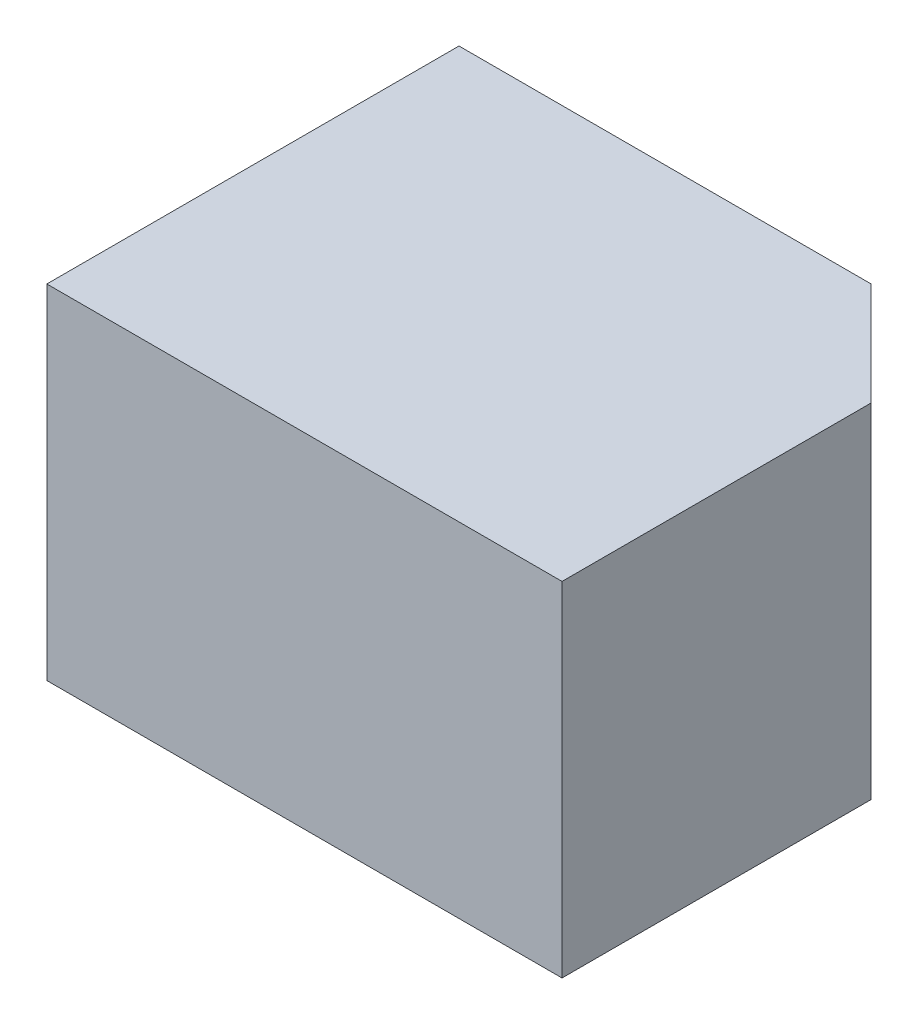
from build123d import *

# Parameters (mm, degrees)
BOSS_EXTRUDE1_DEPTH = 5
SKETCH2_R           = 1.25
CUT_EXTRUDE1_DEPTH  = 4
SKETCH4_R           = 0.795
CUT_EXTRUDE2_DEPTH  = 0.79


with BuildPart() as part:
    # Sketch1 → Boss-Extrude1 (new body)
    with BuildSketch(Plane(origin=(0, 0, 0), x_dir=(1, 0, 0), z_dir=(0, 1, 0))):
        Polygon((1.576205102, 3.539035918), (3.076205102, 2.039035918), (3.076205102, -2.460964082), (-4.423794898, -2.460964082), (-4.423794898, 3.539035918), align=None)
    extrude(amount=BOSS_EXTRUDE1_DEPTH)

    # Sketch2 → Cut-Extrude1 (cut)
    with BuildSketch(Plane.XZ):
        with Locations(Location((-1.173794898, -0.539035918, 0), (0, 0, 270))):
            Circle(SKETCH2_R)
    extrude(amount=-CUT_EXTRUDE1_DEPTH, mode=Mode.SUBTRACT)

    # Sketch4 → Cut-Extrude2 (cut)
    with BuildSketch(Plane.XZ):
        with Locations(Location((-3.173794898, 1.460964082, 0), (0, 0, 270))):
            Circle(SKETCH4_R)
        with Locations(Location((1.826205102, 1.460964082, 0), (0, 0, 270))):
            Circle(SKETCH4_R)
        with Locations((1.826205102, -2.539035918)):
            Circle(SKETCH4_R)
        with Locations(Location((-3.173794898, -2.539035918, 0), (0, 0, 270))):
            Circle(SKETCH4_R)
    extrude(amount=-CUT_EXTRUDE2_DEPTH, mode=Mode.SUBTRACT)


solid = part.part
